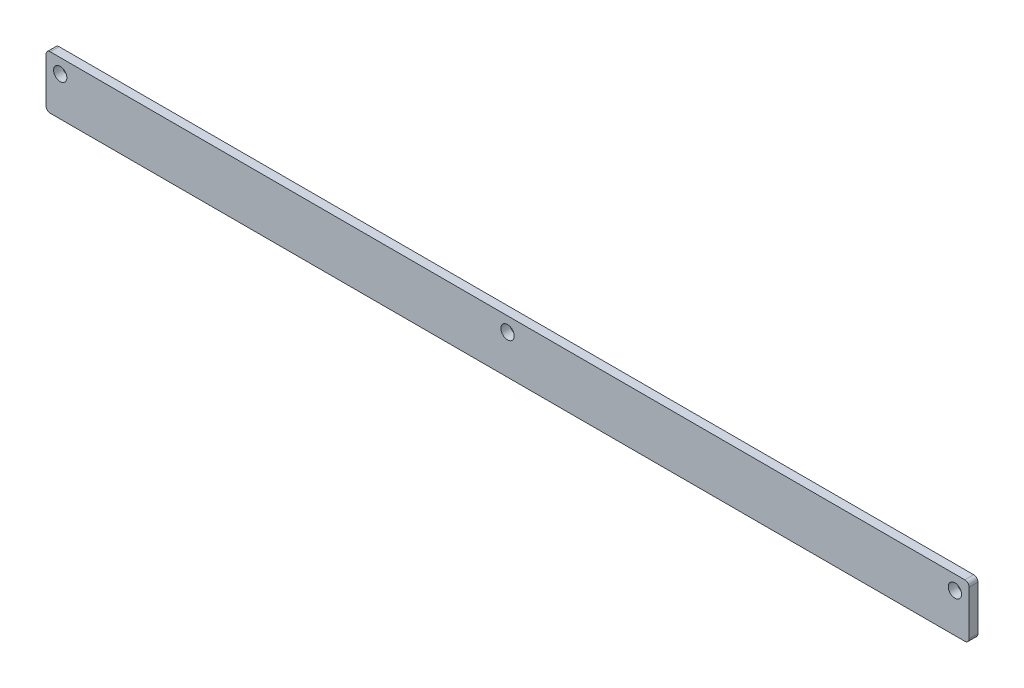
ISO-10303-21;
HEADER;
FILE_DESCRIPTION(('STEP AP214'),'2;1');
FILE_NAME('part.step','',(''),(''),'','','');
FILE_SCHEMA(('AUTOMOTIVE_DESIGN { 1 0 10303 214 1 1 1 1 }'));
ENDSEC;
DATA;
#1=APPLICATION_CONTEXT('core data for automotive mechanical design processes');
#2=APPLICATION_PROTOCOL_DEFINITION('international standard','automotive_design',2000,#1);
#3=PRODUCT_CONTEXT('',#1,'mechanical');
#4=PRODUCT('Part','Part','',(#3));
#5=PRODUCT_RELATED_PRODUCT_CATEGORY('part','',(#4));
#6=PRODUCT_DEFINITION_FORMATION('','',#4);
#7=PRODUCT_DEFINITION_CONTEXT('part definition',#1,'design');
#8=PRODUCT_DEFINITION('design','',#6,#7);
#9=PRODUCT_DEFINITION_SHAPE('','',#8);
#10=(LENGTH_UNIT() NAMED_UNIT(*) SI_UNIT(.MILLI.,.METRE.));
#11=(NAMED_UNIT(*) PLANE_ANGLE_UNIT() SI_UNIT($,.RADIAN.));
#12=(NAMED_UNIT(*) SI_UNIT($,.STERADIAN.) SOLID_ANGLE_UNIT());
#13=UNCERTAINTY_MEASURE_WITH_UNIT(LENGTH_MEASURE(1.E-05),#10,'distance_accuracy_value','');
#14=(GEOMETRIC_REPRESENTATION_CONTEXT(3) GLOBAL_UNCERTAINTY_ASSIGNED_CONTEXT((#13)) GLOBAL_UNIT_ASSIGNED_CONTEXT((#10,
#11,#12)) REPRESENTATION_CONTEXT('',''));
#15=CARTESIAN_POINT('',(0.,0.,0.));
#16=DIRECTION('',(0.,0.,1.));
#17=DIRECTION('',(1.,0.,0.));
#18=AXIS2_PLACEMENT_3D('',#15,#16,#17);
#19=CARTESIAN_POINT('',(-951.9285,180.9115,3.175));
#20=DIRECTION('',(0.,0.,-1.));
#21=DIRECTION('',(-1.,0.,0.));
#22=AXIS2_PLACEMENT_3D('',#19,#20,#21);
#23=CYLINDRICAL_SURFACE('',#22,1.52399999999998);
#24=CARTESIAN_POINT('',(-951.9285,180.9115,0.));
#25=DIRECTION('',(0.,0.,1.));
#26=DIRECTION('',(-1.,0.,0.));
#27=AXIS2_PLACEMENT_3D('',#24,#25,#26);
#28=CIRCLE('',#27,1.52399999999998);
#29=CARTESIAN_POINT('',(-953.4525,180.9115,0.));
#30=VERTEX_POINT('',#29);
#31=CARTESIAN_POINT('',(-951.9285,179.3875,0.));
#32=VERTEX_POINT('',#31);
#33=EDGE_CURVE('E149',#30,#32,#28,.T.);
#34=ORIENTED_EDGE('',*,*,#33,.T.);
#35=DIRECTION('',(0.,0.,-1.));
#36=VECTOR('',#35,1.);
#37=CARTESIAN_POINT('',(-951.9285,179.3875,3.175));
#38=LINE('',#37,#36);
#39=CARTESIAN_POINT('',(-951.9285,179.3875,3.175));
#40=VERTEX_POINT('',#39);
#41=EDGE_CURVE('E11',#40,#32,#38,.T.);
#42=ORIENTED_EDGE('',*,*,#41,.F.);
#43=CARTESIAN_POINT('',(-951.9285,180.9115,3.175));
#44=DIRECTION('',(0.,0.,1.));
#45=DIRECTION('',(-1.,0.,0.));
#46=AXIS2_PLACEMENT_3D('',#43,#44,#45);
#47=CIRCLE('',#46,1.52399999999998);
#48=CARTESIAN_POINT('',(-953.4525,180.9115,3.175));
#49=VERTEX_POINT('',#48);
#50=EDGE_CURVE('E172',#49,#40,#47,.T.);
#51=ORIENTED_EDGE('',*,*,#50,.F.);
#52=DIRECTION('',(0.,0.,-1.));
#53=VECTOR('',#52,1.);
#54=CARTESIAN_POINT('',(-953.4525,180.9115,3.175));
#55=LINE('',#54,#53);
#56=EDGE_CURVE('E145',#49,#30,#55,.T.);
#57=ORIENTED_EDGE('',*,*,#56,.T.);
#58=EDGE_LOOP('',(#34,#42,#51,#57));
#59=FACE_BOUND('',#58,.T.);
#60=ADVANCED_FACE('F47',(#59),#23,.T.);
#61=CARTESIAN_POINT('',(-624.7765,179.3875,3.175));
#62=DIRECTION('',(0.,1.,0.));
#63=DIRECTION('',(-1.,0.,0.));
#64=AXIS2_PLACEMENT_3D('',#61,#62,#63);
#65=PLANE('',#64);
#66=DIRECTION('',(1.,0.,0.));
#67=VECTOR('',#66,1.);
#68=CARTESIAN_POINT('',(-624.7765,179.3875,0.));
#69=LINE('',#68,#67);
#70=CARTESIAN_POINT('',(-624.7765,179.3875,0.));
#71=VERTEX_POINT('',#70);
#72=EDGE_CURVE('E153',#32,#71,#69,.T.);
#73=ORIENTED_EDGE('',*,*,#72,.T.);
#74=DIRECTION('',(0.,0.,-1.));
#75=VECTOR('',#74,1.);
#76=CARTESIAN_POINT('',(-624.7765,179.3875,3.175));
#77=LINE('',#76,#75);
#78=CARTESIAN_POINT('',(-624.7765,179.3875,3.175));
#79=VERTEX_POINT('',#78);
#80=EDGE_CURVE('E56',#79,#71,#77,.T.);
#81=ORIENTED_EDGE('',*,*,#80,.F.);
#82=DIRECTION('',(1.,0.,0.));
#83=VECTOR('',#82,1.);
#84=CARTESIAN_POINT('',(-624.7765,179.3875,3.175));
#85=LINE('',#84,#83);
#86=EDGE_CURVE('E107',#40,#79,#85,.T.);
#87=ORIENTED_EDGE('',*,*,#86,.F.);
#88=ORIENTED_EDGE('',*,*,#41,.T.);
#89=EDGE_LOOP('',(#73,#81,#87,#88));
#90=FACE_BOUND('',#89,.T.);
#91=ADVANCED_FACE('F273',(#90),#65,.F.);
#92=CARTESIAN_POINT('',(-624.7765,180.9115,3.175));
#93=DIRECTION('',(0.,0.,-1.));
#94=DIRECTION('',(-1.,0.,0.));
#95=AXIS2_PLACEMENT_3D('',#92,#93,#94);
#96=CYLINDRICAL_SURFACE('',#95,1.52399999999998);
#97=CARTESIAN_POINT('',(-624.7765,180.9115,0.));
#98=DIRECTION('',(0.,0.,1.));
#99=DIRECTION('',(1.,0.,0.));
#100=AXIS2_PLACEMENT_3D('',#97,#98,#99);
#101=CIRCLE('',#100,1.52399999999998);
#102=CARTESIAN_POINT('',(-623.2525,180.9115,0.));
#103=VERTEX_POINT('',#102);
#104=EDGE_CURVE('E157',#71,#103,#101,.T.);
#105=ORIENTED_EDGE('',*,*,#104,.T.);
#106=DIRECTION('',(0.,0.,-1.));
#107=VECTOR('',#106,1.);
#108=CARTESIAN_POINT('',(-623.2525,180.9115,3.175));
#109=LINE('',#108,#107);
#110=CARTESIAN_POINT('',(-623.2525,180.9115,3.175));
#111=VERTEX_POINT('',#110);
#112=EDGE_CURVE('E183',#111,#103,#109,.T.);
#113=ORIENTED_EDGE('',*,*,#112,.F.);
#114=CARTESIAN_POINT('',(-624.7765,180.9115,3.175));
#115=DIRECTION('',(0.,0.,1.));
#116=DIRECTION('',(1.,0.,0.));
#117=AXIS2_PLACEMENT_3D('',#114,#115,#116);
#118=CIRCLE('',#117,1.52399999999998);
#119=EDGE_CURVE('E194',#79,#111,#118,.T.);
#120=ORIENTED_EDGE('',*,*,#119,.F.);
#121=ORIENTED_EDGE('',*,*,#80,.T.);
#122=EDGE_LOOP('',(#105,#113,#120,#121));
#123=FACE_BOUND('',#122,.T.);
#124=ADVANCED_FACE('F192',(#123),#96,.T.);
#125=CARTESIAN_POINT('',(-623.2525,180.9115,3.175));
#126=DIRECTION('',(-1.,0.,0.));
#127=DIRECTION('',(0.,0.,1.));
#128=AXIS2_PLACEMENT_3D('',#125,#126,#127);
#129=PLANE('',#128);
#130=DIRECTION('',(0.,1.,0.));
#131=VECTOR('',#130,1.);
#132=CARTESIAN_POINT('',(-623.2525,180.9115,0.));
#133=LINE('',#132,#131);
#134=CARTESIAN_POINT('',(-623.2525,196.9135,0.));
#135=VERTEX_POINT('',#134);
#136=EDGE_CURVE('E160',#103,#135,#133,.T.);
#137=ORIENTED_EDGE('',*,*,#136,.T.);
#138=DIRECTION('',(0.,0.,-1.));
#139=VECTOR('',#138,1.);
#140=CARTESIAN_POINT('',(-623.2525,196.9135,3.175));
#141=LINE('',#140,#139);
#142=CARTESIAN_POINT('',(-623.2525,196.9135,3.175));
#143=VERTEX_POINT('',#142);
#144=EDGE_CURVE('E179',#143,#135,#141,.T.);
#145=ORIENTED_EDGE('',*,*,#144,.F.);
#146=DIRECTION('',(0.,1.,0.));
#147=VECTOR('',#146,1.);
#148=CARTESIAN_POINT('',(-623.2525,180.9115,3.175));
#149=LINE('',#148,#147);
#150=EDGE_CURVE('E207',#111,#143,#149,.T.);
#151=ORIENTED_EDGE('',*,*,#150,.F.);
#152=ORIENTED_EDGE('',*,*,#112,.T.);
#153=EDGE_LOOP('',(#137,#145,#151,#152));
#154=FACE_BOUND('',#153,.T.);
#155=ADVANCED_FACE('F202',(#154),#129,.F.);
#156=CARTESIAN_POINT('',(-624.7765,196.9135,3.175));
#157=DIRECTION('',(0.,0.,-1.));
#158=DIRECTION('',(-1.,0.,0.));
#159=AXIS2_PLACEMENT_3D('',#156,#157,#158);
#160=CYLINDRICAL_SURFACE('',#159,1.52399999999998);
#161=CARTESIAN_POINT('',(-624.7765,196.9135,0.));
#162=DIRECTION('',(0.,0.,1.));
#163=DIRECTION('',(1.,0.,0.));
#164=AXIS2_PLACEMENT_3D('',#161,#162,#163);
#165=CIRCLE('',#164,1.52399999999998);
#166=CARTESIAN_POINT('',(-624.7765,198.4375,0.));
#167=VERTEX_POINT('',#166);
#168=EDGE_CURVE('E163',#135,#167,#165,.T.);
#169=ORIENTED_EDGE('',*,*,#168,.T.);
#170=DIRECTION('',(0.,0.,-1.));
#171=VECTOR('',#170,1.);
#172=CARTESIAN_POINT('',(-624.7765,198.4375,3.175));
#173=LINE('',#172,#171);
#174=CARTESIAN_POINT('',(-624.7765,198.4375,3.175));
#175=VERTEX_POINT('',#174);
#176=EDGE_CURVE('E137',#175,#167,#173,.T.);
#177=ORIENTED_EDGE('',*,*,#176,.F.);
#178=CARTESIAN_POINT('',(-624.7765,196.9135,3.175));
#179=DIRECTION('',(0.,0.,1.));
#180=DIRECTION('',(1.,0.,0.));
#181=AXIS2_PLACEMENT_3D('',#178,#179,#180);
#182=CIRCLE('',#181,1.52399999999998);
#183=EDGE_CURVE('E126',#143,#175,#182,.T.);
#184=ORIENTED_EDGE('',*,*,#183,.F.);
#185=ORIENTED_EDGE('',*,*,#144,.T.);
#186=EDGE_LOOP('',(#169,#177,#184,#185));
#187=FACE_BOUND('',#186,.T.);
#188=ADVANCED_FACE('F205',(#187),#160,.T.);
#189=CARTESIAN_POINT('',(-624.7765,198.4375,3.175));
#190=DIRECTION('',(0.,-1.,0.));
#191=DIRECTION('',(1.,0.,0.));
#192=AXIS2_PLACEMENT_3D('',#189,#190,#191);
#193=PLANE('',#192);
#194=DIRECTION('',(-1.,0.,0.));
#195=VECTOR('',#194,1.);
#196=CARTESIAN_POINT('',(-624.7765,198.4375,0.));
#197=LINE('',#196,#195);
#198=CARTESIAN_POINT('',(-951.9285,198.4375,0.));
#199=VERTEX_POINT('',#198);
#200=EDGE_CURVE('E135',#167,#199,#197,.T.);
#201=ORIENTED_EDGE('',*,*,#200,.T.);
#202=DIRECTION('',(0.,0.,-1.));
#203=VECTOR('',#202,1.);
#204=CARTESIAN_POINT('',(-951.9285,198.4375,3.175));
#205=LINE('',#204,#203);
#206=CARTESIAN_POINT('',(-951.9285,198.4375,3.175));
#207=VERTEX_POINT('',#206);
#208=EDGE_CURVE('E132',#207,#199,#205,.T.);
#209=ORIENTED_EDGE('',*,*,#208,.F.);
#210=DIRECTION('',(-1.,0.,0.));
#211=VECTOR('',#210,1.);
#212=CARTESIAN_POINT('',(-624.7765,198.4375,3.175));
#213=LINE('',#212,#211);
#214=EDGE_CURVE('E120',#175,#207,#213,.T.);
#215=ORIENTED_EDGE('',*,*,#214,.F.);
#216=ORIENTED_EDGE('',*,*,#176,.T.);
#217=EDGE_LOOP('',(#201,#209,#215,#216));
#218=FACE_BOUND('',#217,.T.);
#219=ADVANCED_FACE('F133',(#218),#193,.F.);
#220=CARTESIAN_POINT('',(-951.9285,196.9135,3.175));
#221=DIRECTION('',(0.,0.,-1.));
#222=DIRECTION('',(-1.,0.,0.));
#223=AXIS2_PLACEMENT_3D('',#220,#221,#222);
#224=CYLINDRICAL_SURFACE('',#223,1.52399999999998);
#225=CARTESIAN_POINT('',(-951.9285,196.9135,0.));
#226=DIRECTION('',(0.,0.,1.));
#227=DIRECTION('',(1.,0.,0.));
#228=AXIS2_PLACEMENT_3D('',#225,#226,#227);
#229=CIRCLE('',#228,1.52399999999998);
#230=CARTESIAN_POINT('',(-953.4525,196.9135,0.));
#231=VERTEX_POINT('',#230);
#232=EDGE_CURVE('E93',#199,#231,#229,.T.);
#233=ORIENTED_EDGE('',*,*,#232,.T.);
#234=DIRECTION('',(0.,0.,-1.));
#235=VECTOR('',#234,1.);
#236=CARTESIAN_POINT('',(-953.4525,196.9135,3.175));
#237=LINE('',#236,#235);
#238=CARTESIAN_POINT('',(-953.4525,196.9135,3.175));
#239=VERTEX_POINT('',#238);
#240=EDGE_CURVE('E138',#239,#231,#237,.T.);
#241=ORIENTED_EDGE('',*,*,#240,.F.);
#242=CARTESIAN_POINT('',(-951.9285,196.9135,3.175));
#243=DIRECTION('',(0.,0.,1.));
#244=DIRECTION('',(1.,0.,0.));
#245=AXIS2_PLACEMENT_3D('',#242,#243,#244);
#246=CIRCLE('',#245,1.52399999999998);
#247=EDGE_CURVE('E124',#207,#239,#246,.T.);
#248=ORIENTED_EDGE('',*,*,#247,.F.);
#249=ORIENTED_EDGE('',*,*,#208,.T.);
#250=EDGE_LOOP('',(#233,#241,#248,#249));
#251=FACE_BOUND('',#250,.T.);
#252=ADVANCED_FACE('F140',(#251),#224,.T.);
#253=CARTESIAN_POINT('',(-953.4525,180.9115,3.175));
#254=DIRECTION('',(1.,0.,0.));
#255=DIRECTION('',(0.,0.,-1.));
#256=AXIS2_PLACEMENT_3D('',#253,#254,#255);
#257=PLANE('',#256);
#258=DIRECTION('',(0.,-1.,0.));
#259=VECTOR('',#258,1.);
#260=CARTESIAN_POINT('',(-953.4525,180.9115,0.));
#261=LINE('',#260,#259);
#262=EDGE_CURVE('E99',#231,#30,#261,.T.);
#263=ORIENTED_EDGE('',*,*,#262,.T.);
#264=ORIENTED_EDGE('',*,*,#56,.F.);
#265=DIRECTION('',(0.,-1.,0.));
#266=VECTOR('',#265,1.);
#267=CARTESIAN_POINT('',(-953.4525,180.9115,3.175));
#268=LINE('',#267,#266);
#269=EDGE_CURVE('E64',#239,#49,#268,.T.);
#270=ORIENTED_EDGE('',*,*,#269,.F.);
#271=ORIENTED_EDGE('',*,*,#240,.T.);
#272=EDGE_LOOP('',(#263,#264,#270,#271));
#273=FACE_BOUND('',#272,.T.);
#274=ADVANCED_FACE('F254',(#273),#257,.F.);
#275=CARTESIAN_POINT('',(-951.9285,180.9115,3.175));
#276=DIRECTION('',(0.,0.,-1.));
#277=DIRECTION('',(-1.,0.,0.));
#278=AXIS2_PLACEMENT_3D('',#275,#276,#277);
#279=PLANE('',#278);
#280=CARTESIAN_POINT('',(-628.3325,193.3575,3.175));
#281=DIRECTION('',(0.,0.,1.));
#282=DIRECTION('',(1.,0.,0.));
#283=AXIS2_PLACEMENT_3D('',#280,#281,#282);
#284=CIRCLE('',#283,2.38125);
#285=CARTESIAN_POINT('',(-625.95125,193.3575,3.175));
#286=VERTEX_POINT('',#285);
#287=EDGE_CURVE('E233',#286,#286,#284,.T.);
#288=ORIENTED_EDGE('',*,*,#287,.F.);
#289=EDGE_LOOP('',(#288));
#290=FACE_BOUND('',#289,.T.);
#291=CARTESIAN_POINT('',(-948.3725,193.3575,3.175));
#292=DIRECTION('',(0.,0.,1.));
#293=DIRECTION('',(1.,0.,0.));
#294=AXIS2_PLACEMENT_3D('',#291,#292,#293);
#295=CIRCLE('',#294,2.38125);
#296=CARTESIAN_POINT('',(-945.99125,193.3575,3.175));
#297=VERTEX_POINT('',#296);
#298=EDGE_CURVE('E225',#297,#297,#295,.T.);
#299=ORIENTED_EDGE('',*,*,#298,.F.);
#300=EDGE_LOOP('',(#299));
#301=FACE_BOUND('',#300,.T.);
#302=CARTESIAN_POINT('',(-788.3525,193.3575,3.175));
#303=DIRECTION('',(0.,0.,1.));
#304=DIRECTION('',(1.,0.,0.));
#305=AXIS2_PLACEMENT_3D('',#302,#303,#304);
#306=CIRCLE('',#305,2.38125);
#307=CARTESIAN_POINT('',(-785.97125,193.3575,3.175));
#308=VERTEX_POINT('',#307);
#309=EDGE_CURVE('E154',#308,#308,#306,.T.);
#310=ORIENTED_EDGE('',*,*,#309,.F.);
#311=EDGE_LOOP('',(#310));
#312=FACE_BOUND('',#311,.T.);
#313=ORIENTED_EDGE('',*,*,#50,.T.);
#314=ORIENTED_EDGE('',*,*,#86,.T.);
#315=ORIENTED_EDGE('',*,*,#119,.T.);
#316=ORIENTED_EDGE('',*,*,#150,.T.);
#317=ORIENTED_EDGE('',*,*,#183,.T.);
#318=ORIENTED_EDGE('',*,*,#214,.T.);
#319=ORIENTED_EDGE('',*,*,#247,.T.);
#320=ORIENTED_EDGE('',*,*,#269,.T.);
#321=EDGE_LOOP('',(#313,#314,#315,#316,#317,#318,#319,#320));
#322=FACE_BOUND('',#321,.T.);
#323=ADVANCED_FACE('F122',(#290,#301,#312,#322),#279,.F.);
#324=CARTESIAN_POINT('',(-951.9285,180.9115,0.));
#325=DIRECTION('',(0.,0.,-1.));
#326=DIRECTION('',(-1.,0.,0.));
#327=AXIS2_PLACEMENT_3D('',#324,#325,#326);
#328=PLANE('',#327);
#329=CARTESIAN_POINT('',(-628.3325,193.3575,0.));
#330=DIRECTION('',(0.,0.,1.));
#331=DIRECTION('',(1.,0.,0.));
#332=AXIS2_PLACEMENT_3D('',#329,#330,#331);
#333=CIRCLE('',#332,2.38125);
#334=CARTESIAN_POINT('',(-625.95125,193.3575,0.));
#335=VERTEX_POINT('',#334);
#336=EDGE_CURVE('E237',#335,#335,#333,.T.);
#337=ORIENTED_EDGE('',*,*,#336,.T.);
#338=EDGE_LOOP('',(#337));
#339=FACE_BOUND('',#338,.T.);
#340=CARTESIAN_POINT('',(-948.3725,193.3575,0.));
#341=DIRECTION('',(0.,0.,1.));
#342=DIRECTION('',(1.,0.,0.));
#343=AXIS2_PLACEMENT_3D('',#340,#341,#342);
#344=CIRCLE('',#343,2.38125);
#345=CARTESIAN_POINT('',(-945.99125,193.3575,0.));
#346=VERTEX_POINT('',#345);
#347=EDGE_CURVE('E229',#346,#346,#344,.T.);
#348=ORIENTED_EDGE('',*,*,#347,.T.);
#349=EDGE_LOOP('',(#348));
#350=FACE_BOUND('',#349,.T.);
#351=CARTESIAN_POINT('',(-788.3525,193.3575,0.));
#352=DIRECTION('',(0.,0.,1.));
#353=DIRECTION('',(1.,0.,0.));
#354=AXIS2_PLACEMENT_3D('',#351,#352,#353);
#355=CIRCLE('',#354,2.38125);
#356=CARTESIAN_POINT('',(-785.97125,193.3575,0.));
#357=VERTEX_POINT('',#356);
#358=EDGE_CURVE('E221',#357,#357,#355,.T.);
#359=ORIENTED_EDGE('',*,*,#358,.T.);
#360=EDGE_LOOP('',(#359));
#361=FACE_BOUND('',#360,.T.);
#362=ORIENTED_EDGE('',*,*,#33,.F.);
#363=ORIENTED_EDGE('',*,*,#262,.F.);
#364=ORIENTED_EDGE('',*,*,#232,.F.);
#365=ORIENTED_EDGE('',*,*,#200,.F.);
#366=ORIENTED_EDGE('',*,*,#168,.F.);
#367=ORIENTED_EDGE('',*,*,#136,.F.);
#368=ORIENTED_EDGE('',*,*,#104,.F.);
#369=ORIENTED_EDGE('',*,*,#72,.F.);
#370=EDGE_LOOP('',(#362,#363,#364,#365,#366,#367,#368,#369));
#371=FACE_BOUND('',#370,.T.);
#372=ADVANCED_FACE('F198',(#339,#350,#361,#371),#328,.T.);
#373=CARTESIAN_POINT('',(-788.3525,193.3575,3.175));
#374=DIRECTION('',(0.,0.,1.));
#375=DIRECTION('',(1.,0.,0.));
#376=AXIS2_PLACEMENT_3D('',#373,#374,#375);
#377=CYLINDRICAL_SURFACE('',#376,2.38125);
#378=ORIENTED_EDGE('',*,*,#358,.F.);
#379=EDGE_LOOP('',(#378));
#380=FACE_BOUND('',#379,.T.);
#381=ORIENTED_EDGE('',*,*,#309,.T.);
#382=EDGE_LOOP('',(#381));
#383=FACE_BOUND('',#382,.T.);
#384=ADVANCED_FACE('F260',(#380,#383),#377,.F.);
#385=CARTESIAN_POINT('',(-948.3725,193.3575,3.175));
#386=DIRECTION('',(0.,0.,1.));
#387=DIRECTION('',(1.,0.,0.));
#388=AXIS2_PLACEMENT_3D('',#385,#386,#387);
#389=CYLINDRICAL_SURFACE('',#388,2.38125);
#390=ORIENTED_EDGE('',*,*,#347,.F.);
#391=EDGE_LOOP('',(#390));
#392=FACE_BOUND('',#391,.T.);
#393=ORIENTED_EDGE('',*,*,#298,.T.);
#394=EDGE_LOOP('',(#393));
#395=FACE_BOUND('',#394,.T.);
#396=ADVANCED_FACE('F248',(#392,#395),#389,.F.);
#397=CARTESIAN_POINT('',(-628.3325,193.3575,3.175));
#398=DIRECTION('',(0.,0.,1.));
#399=DIRECTION('',(1.,0.,0.));
#400=AXIS2_PLACEMENT_3D('',#397,#398,#399);
#401=CYLINDRICAL_SURFACE('',#400,2.38125);
#402=ORIENTED_EDGE('',*,*,#336,.F.);
#403=EDGE_LOOP('',(#402));
#404=FACE_BOUND('',#403,.T.);
#405=ORIENTED_EDGE('',*,*,#287,.T.);
#406=EDGE_LOOP('',(#405));
#407=FACE_BOUND('',#406,.T.);
#408=ADVANCED_FACE('F245',(#404,#407),#401,.F.);
#409=CLOSED_SHELL('',(#60,#91,#124,#155,#188,#219,#252,#274,#323,#372,#384,#396,#408));
#410=MANIFOLD_SOLID_BREP('B2',#409);
#411=ADVANCED_BREP_SHAPE_REPRESENTATION('',(#18,#410),#14);
#412=SHAPE_DEFINITION_REPRESENTATION(#9,#411);
ENDSEC;
END-ISO-10303-21;
